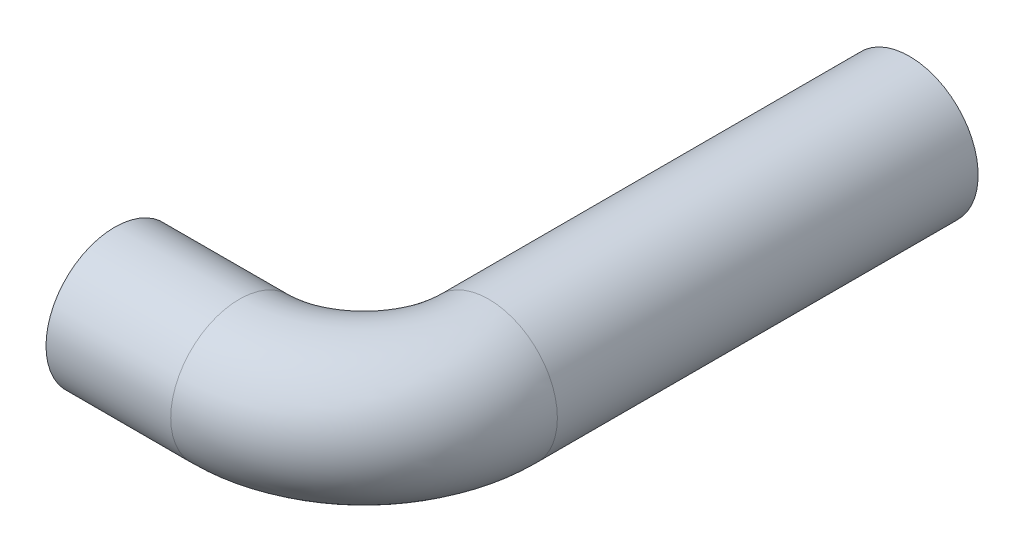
from build123d import *

# Parameters (mm, degrees)
SKETCH1_R = 1.65


with BuildPart() as part:
    # Sweep1: sweep along a path in Sketch2
    with BuildLine(Plane(origin=(0, 0, 0), x_dir=(1, 0, 0), z_dir=(0, 1, 0))) as sweep1_path:
        Line((0, 0), (3, 0))
        ThreePointArc((3, 0), (5.121320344, 0.878679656), (6, 3))
        Line((6, 3), (6, 13.12))
    # Sketch1 → Sweep1 (sweep)
    with BuildSketch(Plane(origin=(0, 0, 0), x_dir=(0, 0, -1), z_dir=(1, 0, 0))):
        Circle(SKETCH1_R)
    sweep(path=sweep1_path.line)


solid = part.part
